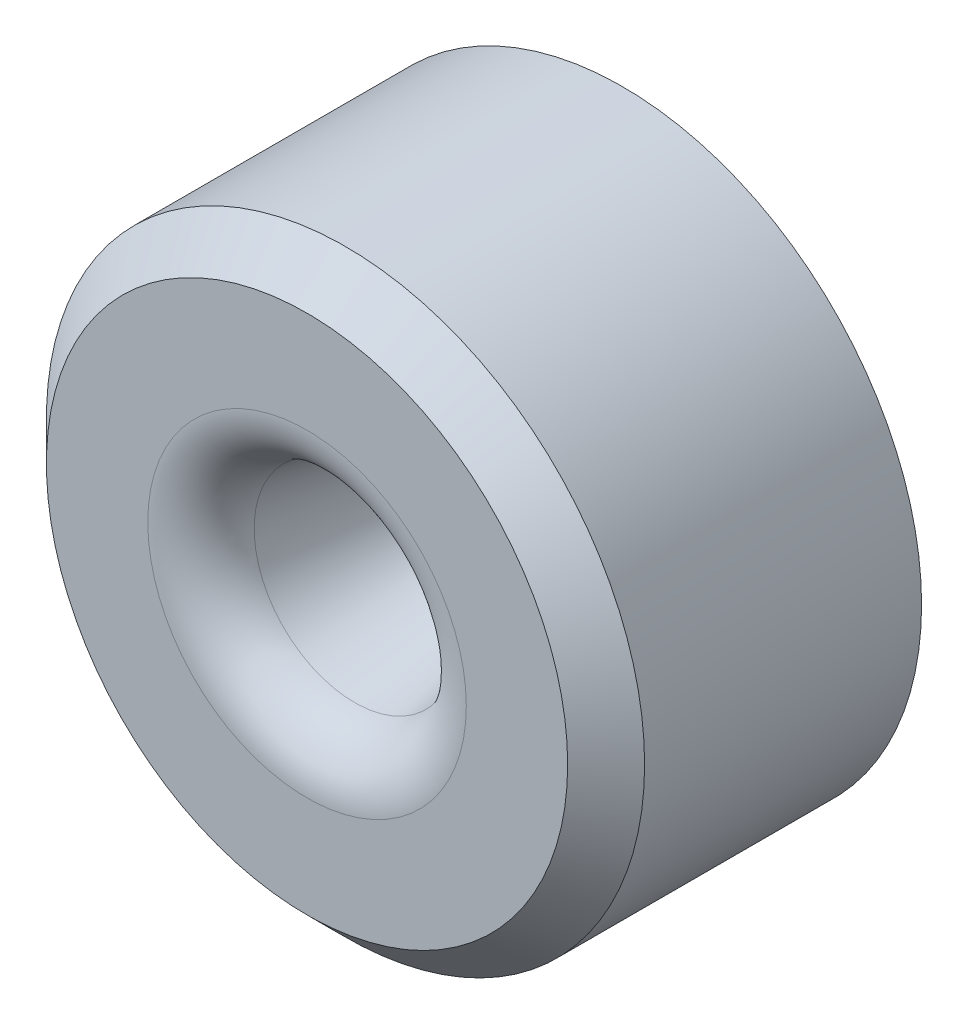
ISO-10303-21;
HEADER;
FILE_DESCRIPTION(('STEP AP214'),'2;1');
FILE_NAME('part.step','',(''),(''),'','','');
FILE_SCHEMA(('AUTOMOTIVE_DESIGN { 1 0 10303 214 1 1 1 1 }'));
ENDSEC;
DATA;
#1=APPLICATION_CONTEXT('core data for automotive mechanical design processes');
#2=APPLICATION_PROTOCOL_DEFINITION('international standard','automotive_design',2000,#1);
#3=PRODUCT_CONTEXT('',#1,'mechanical');
#4=PRODUCT('Part','Part','',(#3));
#5=PRODUCT_RELATED_PRODUCT_CATEGORY('part','',(#4));
#6=PRODUCT_DEFINITION_FORMATION('','',#4);
#7=PRODUCT_DEFINITION_CONTEXT('part definition',#1,'design');
#8=PRODUCT_DEFINITION('design','',#6,#7);
#9=PRODUCT_DEFINITION_SHAPE('','',#8);
#10=(LENGTH_UNIT() NAMED_UNIT(*) SI_UNIT(.MILLI.,.METRE.));
#11=(NAMED_UNIT(*) PLANE_ANGLE_UNIT() SI_UNIT($,.RADIAN.));
#12=(NAMED_UNIT(*) SI_UNIT($,.STERADIAN.) SOLID_ANGLE_UNIT());
#13=UNCERTAINTY_MEASURE_WITH_UNIT(LENGTH_MEASURE(1.E-05),#10,'distance_accuracy_value','');
#14=(GEOMETRIC_REPRESENTATION_CONTEXT(3) GLOBAL_UNCERTAINTY_ASSIGNED_CONTEXT((#13)) GLOBAL_UNIT_ASSIGNED_CONTEXT((#10,
#11,#12)) REPRESENTATION_CONTEXT('',''));
#15=CARTESIAN_POINT('',(0.,0.,0.));
#16=DIRECTION('',(0.,0.,1.));
#17=DIRECTION('',(1.,0.,0.));
#18=AXIS2_PLACEMENT_3D('',#15,#16,#17);
#19=CARTESIAN_POINT('',(0.,0.,-0.508000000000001));
#20=DIRECTION('',(0.,0.,-1.));
#21=DIRECTION('',(-1.,0.,0.));
#22=AXIS2_PLACEMENT_3D('',#19,#20,#21);
#23=CONICAL_SURFACE('',#22,3.9497,0.785398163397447);
#24=CARTESIAN_POINT('',(0.,0.,0.));
#25=DIRECTION('',(0.,0.,1.));
#26=DIRECTION('',(1.,0.,0.));
#27=AXIS2_PLACEMENT_3D('',#24,#25,#26);
#28=CIRCLE('',#27,3.4417);
#29=CARTESIAN_POINT('',(3.4417,0.,0.));
#30=VERTEX_POINT('',#29);
#31=EDGE_CURVE('E10',#30,#30,#28,.T.);
#32=ORIENTED_EDGE('',*,*,#31,.F.);
#33=EDGE_LOOP('',(#32));
#34=FACE_BOUND('',#33,.T.);
#35=CARTESIAN_POINT('',(0.,0.,-0.508000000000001));
#36=DIRECTION('',(0.,0.,1.));
#37=DIRECTION('',(1.,0.,0.));
#38=AXIS2_PLACEMENT_3D('',#35,#36,#37);
#39=CIRCLE('',#38,3.9497);
#40=CARTESIAN_POINT('',(3.9497,0.,-0.508000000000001));
#41=VERTEX_POINT('',#40);
#42=EDGE_CURVE('E58',#41,#41,#39,.T.);
#43=ORIENTED_EDGE('',*,*,#42,.T.);
#44=EDGE_LOOP('',(#43));
#45=FACE_BOUND('',#44,.T.);
#46=ADVANCED_FACE('F33',(#34,#45),#23,.T.);
#47=CARTESIAN_POINT('',(0.,2.10326607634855,0.));
#48=DIRECTION('',(0.,0.,-1.));
#49=DIRECTION('',(-1.,0.,0.));
#50=AXIS2_PLACEMENT_3D('',#47,#48,#49);
#51=PLANE('',#50);
#52=CARTESIAN_POINT('',(0.,0.,0.));
#53=DIRECTION('',(0.,0.,1.));
#54=DIRECTION('',(1.,0.,0.));
#55=AXIS2_PLACEMENT_3D('',#52,#53,#54);
#56=CIRCLE('',#55,2.10326607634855);
#57=CARTESIAN_POINT('',(2.10326607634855,0.,0.));
#58=VERTEX_POINT('',#57);
#59=EDGE_CURVE('E39',#58,#58,#56,.T.);
#60=ORIENTED_EDGE('',*,*,#59,.F.);
#61=EDGE_LOOP('',(#60));
#62=FACE_BOUND('',#61,.T.);
#63=ORIENTED_EDGE('',*,*,#31,.T.);
#64=EDGE_LOOP('',(#63));
#65=FACE_BOUND('',#64,.T.);
#66=ADVANCED_FACE('F89',(#62,#65),#51,.F.);
#67=CARTESIAN_POINT('',(0.,0.,-0.79375));
#68=DIRECTION('',(0.,0.,1.));
#69=DIRECTION('',(1.,0.,0.));
#70=AXIS2_PLACEMENT_3D('',#67,#68,#69);
#71=TOROIDAL_SURFACE('',#70,2.10326607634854,0.79375);
#72=CARTESIAN_POINT('',(0.,0.,-0.628720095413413));
#73=DIRECTION('',(0.,0.,1.));
#74=DIRECTION('',(1.,0.,0.));
#75=AXIS2_PLACEMENT_3D('',#72,#73,#74);
#76=CIRCLE('',#75,1.32686141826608);
#77=CARTESIAN_POINT('',(1.32686141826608,0.,-0.628720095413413));
#78=VERTEX_POINT('',#77);
#79=EDGE_CURVE('E43',#78,#78,#76,.T.);
#80=ORIENTED_EDGE('',*,*,#79,.F.);
#81=EDGE_LOOP('',(#80));
#82=FACE_BOUND('',#81,.T.);
#83=ORIENTED_EDGE('',*,*,#59,.T.);
#84=EDGE_LOOP('',(#83));
#85=FACE_BOUND('',#84,.T.);
#86=ADVANCED_FACE('F84',(#82,#85),#71,.T.);
#87=CARTESIAN_POINT('',(0.,0.,-0.628720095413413));
#88=DIRECTION('',(0.,0.,1.));
#89=DIRECTION('',(1.,0.,0.));
#90=AXIS2_PLACEMENT_3D('',#87,#88,#89);
#91=CONICAL_SURFACE('',#90,1.32686141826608,0.209439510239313);
#92=CARTESIAN_POINT('',(0.,0.,-2.27045449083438));
#93=DIRECTION('',(0.,0.,1.));
#94=DIRECTION('',(1.,0.,0.));
#95=AXIS2_PLACEMENT_3D('',#92,#93,#94);
#96=CIRCLE('',#95,0.9779);
#97=CARTESIAN_POINT('',(0.9779,0.,-2.27045449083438));
#98=VERTEX_POINT('',#97);
#99=EDGE_CURVE('E47',#98,#98,#96,.T.);
#100=ORIENTED_EDGE('',*,*,#99,.F.);
#101=EDGE_LOOP('',(#100));
#102=FACE_BOUND('',#101,.T.);
#103=ORIENTED_EDGE('',*,*,#79,.T.);
#104=EDGE_LOOP('',(#103));
#105=FACE_BOUND('',#104,.T.);
#106=ADVANCED_FACE('F78',(#102,#105),#91,.F.);
#107=CARTESIAN_POINT('',(0.,0.,0.));
#108=DIRECTION('',(0.,0.,1.));
#109=DIRECTION('',(1.,0.,0.));
#110=AXIS2_PLACEMENT_3D('',#107,#108,#109);
#111=CYLINDRICAL_SURFACE('',#110,0.977899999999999);
#112=CARTESIAN_POINT('',(0.,0.,-4.1656));
#113=DIRECTION('',(0.,0.,1.));
#114=DIRECTION('',(1.,0.,0.));
#115=AXIS2_PLACEMENT_3D('',#112,#113,#114);
#116=CIRCLE('',#115,0.977899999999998);
#117=CARTESIAN_POINT('',(0.977899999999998,0.,-4.1656));
#118=VERTEX_POINT('',#117);
#119=EDGE_CURVE('E52',#118,#118,#116,.T.);
#120=ORIENTED_EDGE('',*,*,#119,.F.);
#121=EDGE_LOOP('',(#120));
#122=FACE_BOUND('',#121,.T.);
#123=ORIENTED_EDGE('',*,*,#99,.T.);
#124=EDGE_LOOP('',(#123));
#125=FACE_BOUND('',#124,.T.);
#126=ADVANCED_FACE('F72',(#122,#125),#111,.F.);
#127=CARTESIAN_POINT('',(0.,3.9497,-4.1656));
#128=DIRECTION('',(0.,0.,1.));
#129=DIRECTION('',(1.,0.,0.));
#130=AXIS2_PLACEMENT_3D('',#127,#128,#129);
#131=PLANE('',#130);
#132=CARTESIAN_POINT('',(0.,0.,-4.1656));
#133=DIRECTION('',(0.,0.,1.));
#134=DIRECTION('',(1.,0.,0.));
#135=AXIS2_PLACEMENT_3D('',#132,#133,#134);
#136=CIRCLE('',#135,3.9497);
#137=CARTESIAN_POINT('',(3.9497,0.,-4.1656));
#138=VERTEX_POINT('',#137);
#139=EDGE_CURVE('E55',#138,#138,#136,.T.);
#140=ORIENTED_EDGE('',*,*,#139,.F.);
#141=EDGE_LOOP('',(#140));
#142=FACE_BOUND('',#141,.T.);
#143=ORIENTED_EDGE('',*,*,#119,.T.);
#144=EDGE_LOOP('',(#143));
#145=FACE_BOUND('',#144,.T.);
#146=ADVANCED_FACE('F66',(#142,#145),#131,.F.);
#147=CARTESIAN_POINT('',(0.,0.,0.));
#148=DIRECTION('',(0.,0.,1.));
#149=DIRECTION('',(1.,0.,0.));
#150=AXIS2_PLACEMENT_3D('',#147,#148,#149);
#151=CYLINDRICAL_SURFACE('',#150,3.9497);
#152=ORIENTED_EDGE('',*,*,#42,.F.);
#153=EDGE_LOOP('',(#152));
#154=FACE_BOUND('',#153,.T.);
#155=ORIENTED_EDGE('',*,*,#139,.T.);
#156=EDGE_LOOP('',(#155));
#157=FACE_BOUND('',#156,.T.);
#158=ADVANCED_FACE('F63',(#154,#157),#151,.T.);
#159=CLOSED_SHELL('',(#46,#66,#86,#106,#126,#146,#158));
#160=MANIFOLD_SOLID_BREP('B2',#159);
#161=ADVANCED_BREP_SHAPE_REPRESENTATION('',(#18,#160),#14);
#162=SHAPE_DEFINITION_REPRESENTATION(#9,#161);
ENDSEC;
END-ISO-10303-21;
